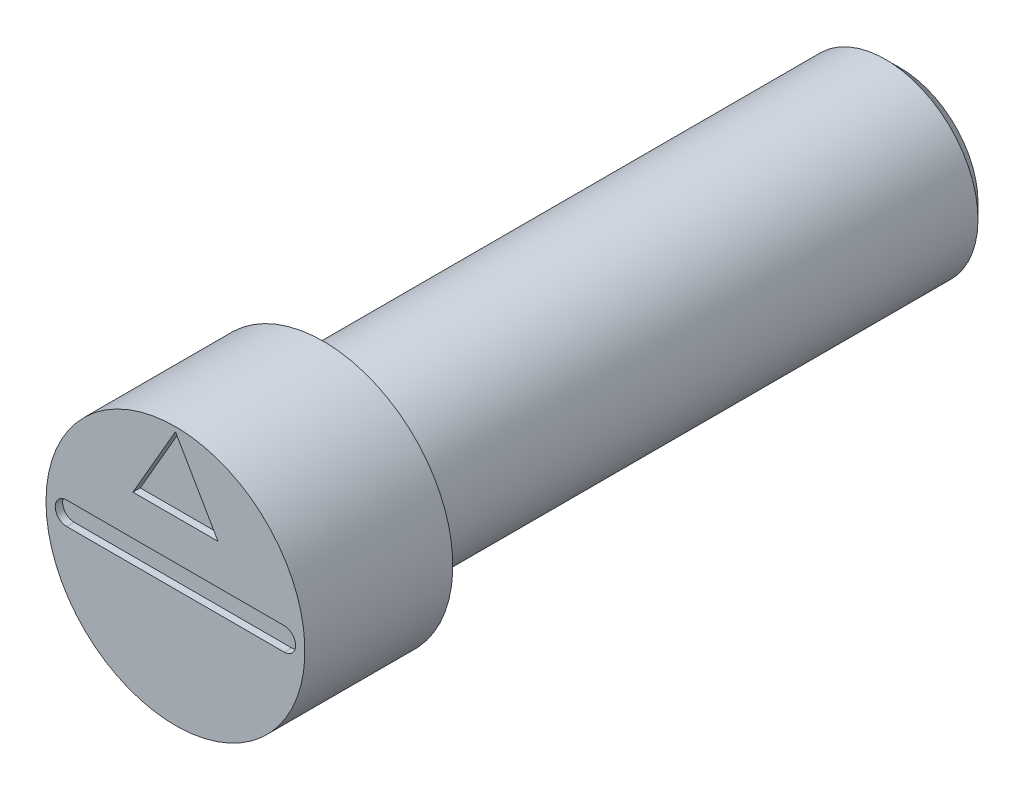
ISO-10303-21;
HEADER;
FILE_DESCRIPTION(('STEP AP214'),'2;1');
FILE_NAME('part.step','',(''),(''),'','','');
FILE_SCHEMA(('AUTOMOTIVE_DESIGN { 1 0 10303 214 1 1 1 1 }'));
ENDSEC;
DATA;
#1=APPLICATION_CONTEXT('core data for automotive mechanical design processes');
#2=APPLICATION_PROTOCOL_DEFINITION('international standard','automotive_design',2000,#1);
#3=PRODUCT_CONTEXT('',#1,'mechanical');
#4=PRODUCT('Part','Part','',(#3));
#5=PRODUCT_RELATED_PRODUCT_CATEGORY('part','',(#4));
#6=PRODUCT_DEFINITION_FORMATION('','',#4);
#7=PRODUCT_DEFINITION_CONTEXT('part definition',#1,'design');
#8=PRODUCT_DEFINITION('design','',#6,#7);
#9=PRODUCT_DEFINITION_SHAPE('','',#8);
#10=(LENGTH_UNIT() NAMED_UNIT(*) SI_UNIT(.MILLI.,.METRE.));
#11=(NAMED_UNIT(*) PLANE_ANGLE_UNIT() SI_UNIT($,.RADIAN.));
#12=(NAMED_UNIT(*) SI_UNIT($,.STERADIAN.) SOLID_ANGLE_UNIT());
#13=UNCERTAINTY_MEASURE_WITH_UNIT(LENGTH_MEASURE(1.E-05),#10,'distance_accuracy_value','');
#14=(GEOMETRIC_REPRESENTATION_CONTEXT(3) GLOBAL_UNCERTAINTY_ASSIGNED_CONTEXT((#13)) GLOBAL_UNIT_ASSIGNED_CONTEXT((#10,
#11,#12)) REPRESENTATION_CONTEXT('',''));
#15=CARTESIAN_POINT('',(0.,0.,0.));
#16=DIRECTION('',(0.,0.,1.));
#17=DIRECTION('',(1.,0.,0.));
#18=AXIS2_PLACEMENT_3D('',#15,#16,#17);
#19=CARTESIAN_POINT('',(0.87499825,0.,0.));
#20=DIRECTION('',(0.,0.,1.));
#21=DIRECTION('',(1.,0.,0.));
#22=AXIS2_PLACEMENT_3D('',#19,#20,#21);
#23=PLANE('',#22);
#24=CARTESIAN_POINT('',(1.47,0.,0.));
#25=DIRECTION('',(0.,0.,1.));
#26=DIRECTION('',(1.,0.,0.));
#27=AXIS2_PLACEMENT_3D('',#24,#25,#26);
#28=CIRCLE('',#27,0.155);
#29=CARTESIAN_POINT('',(1.47,-0.155,0.));
#30=VERTEX_POINT('',#29);
#31=CARTESIAN_POINT('',(1.47,0.155,0.));
#32=VERTEX_POINT('',#31);
#33=EDGE_CURVE('E56',#30,#32,#28,.T.);
#34=ORIENTED_EDGE('',*,*,#33,.F.);
#35=DIRECTION('',(1.,0.,0.));
#36=VECTOR('',#35,1.);
#37=CARTESIAN_POINT('',(-1.47,-0.155,0.));
#38=LINE('',#37,#36);
#39=CARTESIAN_POINT('',(-1.47,-0.155,0.));
#40=VERTEX_POINT('',#39);
#41=EDGE_CURVE('E120',#40,#30,#38,.T.);
#42=ORIENTED_EDGE('',*,*,#41,.F.);
#43=CARTESIAN_POINT('',(-1.47,0.,0.));
#44=DIRECTION('',(0.,0.,1.));
#45=DIRECTION('',(1.,0.,0.));
#46=AXIS2_PLACEMENT_3D('',#43,#44,#45);
#47=CIRCLE('',#46,0.155);
#48=CARTESIAN_POINT('',(-1.47,0.155,0.));
#49=VERTEX_POINT('',#48);
#50=EDGE_CURVE('E123',#49,#40,#47,.T.);
#51=ORIENTED_EDGE('',*,*,#50,.F.);
#52=DIRECTION('',(-1.,0.,0.));
#53=VECTOR('',#52,1.);
#54=CARTESIAN_POINT('',(-1.47,0.155,0.));
#55=LINE('',#54,#53);
#56=EDGE_CURVE('E129',#32,#49,#55,.T.);
#57=ORIENTED_EDGE('',*,*,#56,.F.);
#58=EDGE_LOOP('',(#34,#42,#51,#57));
#59=FACE_BOUND('',#58,.T.);
#60=DIRECTION('',(-0.499999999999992,0.866025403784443,0.));
#61=VECTOR('',#60,1.);
#62=CARTESIAN_POINT('',(0.574999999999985,0.695,0.));
#63=LINE('',#62,#61);
#64=CARTESIAN_POINT('',(0.574999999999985,0.695,0.));
#65=VERTEX_POINT('',#64);
#66=CARTESIAN_POINT('',(0.,1.6909292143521,0.));
#67=VERTEX_POINT('',#66);
#68=EDGE_CURVE('E64',#65,#67,#63,.T.);
#69=ORIENTED_EDGE('',*,*,#68,.F.);
#70=DIRECTION('',(1.,0.,0.));
#71=VECTOR('',#70,1.);
#72=CARTESIAN_POINT('',(-0.575000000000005,0.695,0.));
#73=LINE('',#72,#71);
#74=CARTESIAN_POINT('',(-0.575000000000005,0.695,0.));
#75=VERTEX_POINT('',#74);
#76=EDGE_CURVE('E142',#75,#65,#73,.T.);
#77=ORIENTED_EDGE('',*,*,#76,.F.);
#78=DIRECTION('',(-0.500000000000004,-0.866025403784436,0.));
#79=VECTOR('',#78,1.);
#80=CARTESIAN_POINT('',(0.,1.6909292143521,0.));
#81=LINE('',#80,#79);
#82=EDGE_CURVE('E150',#67,#75,#81,.T.);
#83=ORIENTED_EDGE('',*,*,#82,.F.);
#84=EDGE_LOOP('',(#69,#77,#83));
#85=FACE_BOUND('',#84,.T.);
#86=CARTESIAN_POINT('',(0.,0.,0.));
#87=DIRECTION('',(0.,0.,-1.));
#88=DIRECTION('',(-1.,0.,0.));
#89=AXIS2_PLACEMENT_3D('',#86,#87,#88);
#90=CIRCLE('',#89,1.7499965);
#91=CARTESIAN_POINT('',(-1.74999649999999,0.,0.));
#92=VERTEX_POINT('',#91);
#93=EDGE_CURVE('E157',#92,#92,#90,.T.);
#94=ORIENTED_EDGE('',*,*,#93,.F.);
#95=EDGE_LOOP('',(#94));
#96=FACE_BOUND('',#95,.T.);
#97=ADVANCED_FACE('F40',(#59,#85,#96),#23,.T.);
#98=CARTESIAN_POINT('',(0.,0.,-0.999998));
#99=DIRECTION('',(0.,0.,-1.));
#100=DIRECTION('',(-1.,0.,0.));
#101=AXIS2_PLACEMENT_3D('',#98,#99,#100);
#102=CYLINDRICAL_SURFACE('',#101,1.7499965);
#103=ORIENTED_EDGE('',*,*,#93,.T.);
#104=EDGE_LOOP('',(#103));
#105=FACE_BOUND('',#104,.T.);
#106=CARTESIAN_POINT('',(0.,0.,-1.999996));
#107=DIRECTION('',(0.,0.,-1.));
#108=DIRECTION('',(-1.,0.,0.));
#109=AXIS2_PLACEMENT_3D('',#106,#107,#108);
#110=CIRCLE('',#109,1.7499965);
#111=CARTESIAN_POINT('',(-1.74999649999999,0.,-1.999996));
#112=VERTEX_POINT('',#111);
#113=EDGE_CURVE('E164',#112,#112,#110,.T.);
#114=ORIENTED_EDGE('',*,*,#113,.F.);
#115=EDGE_LOOP('',(#114));
#116=FACE_BOUND('',#115,.T.);
#117=ADVANCED_FACE('F192',(#105,#116),#102,.T.);
#118=CARTESIAN_POINT('',(1.499997,0.,-1.999996));
#119=DIRECTION('',(0.,0.,-1.));
#120=DIRECTION('',(-1.,0.,0.));
#121=AXIS2_PLACEMENT_3D('',#118,#119,#120);
#122=PLANE('',#121);
#123=CARTESIAN_POINT('',(0.,0.,-1.999996));
#124=DIRECTION('',(0.,0.,-1.));
#125=DIRECTION('',(-1.,0.,0.));
#126=AXIS2_PLACEMENT_3D('',#123,#124,#125);
#127=CIRCLE('',#126,1.2499975);
#128=CARTESIAN_POINT('',(-1.24999749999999,0.,-1.999996));
#129=VERTEX_POINT('',#128);
#130=EDGE_CURVE('E161',#129,#129,#127,.T.);
#131=ORIENTED_EDGE('',*,*,#130,.F.);
#132=EDGE_LOOP('',(#131));
#133=FACE_BOUND('',#132,.T.);
#134=ORIENTED_EDGE('',*,*,#113,.T.);
#135=EDGE_LOOP('',(#134));
#136=FACE_BOUND('',#135,.T.);
#137=ADVANCED_FACE('F183',(#133,#136),#122,.T.);
#138=CARTESIAN_POINT('',(0.,0.,-8.499983));
#139=DIRECTION('',(0.,0.,-1.));
#140=DIRECTION('',(-1.,0.,0.));
#141=AXIS2_PLACEMENT_3D('',#138,#139,#140);
#142=CYLINDRICAL_SURFACE('',#141,1.2499975);
#143=CARTESIAN_POINT('',(0.,0.,-9.6));
#144=DIRECTION('',(0.,0.,1.));
#145=DIRECTION('',(1.,0.,0.));
#146=AXIS2_PLACEMENT_3D('',#143,#144,#145);
#147=CIRCLE('',#146,1.2499975);
#148=CARTESIAN_POINT('',(1.24999750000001,0.,-9.6));
#149=VERTEX_POINT('',#148);
#150=EDGE_CURVE('E12',#149,#149,#147,.T.);
#151=ORIENTED_EDGE('',*,*,#150,.T.);
#152=EDGE_LOOP('',(#151));
#153=FACE_BOUND('',#152,.T.);
#154=ORIENTED_EDGE('',*,*,#130,.T.);
#155=EDGE_LOOP('',(#154));
#156=FACE_BOUND('',#155,.T.);
#157=ADVANCED_FACE('F180',(#153,#156),#142,.T.);
#158=CARTESIAN_POINT('',(0.574999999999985,0.695,-0.1));
#159=DIRECTION('',(0.866025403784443,0.499999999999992,0.));
#160=DIRECTION('',(-0.499999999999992,0.866025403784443,0.));
#161=AXIS2_PLACEMENT_3D('',#158,#159,#160);
#162=PLANE('',#161);
#163=ORIENTED_EDGE('',*,*,#68,.T.);
#164=DIRECTION('',(0.,0.,1.));
#165=VECTOR('',#164,1.);
#166=CARTESIAN_POINT('',(0.,1.6909292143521,-0.1));
#167=LINE('',#166,#165);
#168=CARTESIAN_POINT('',(0.,1.6909292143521,-0.1));
#169=VERTEX_POINT('',#168);
#170=EDGE_CURVE('E148',#169,#67,#167,.T.);
#171=ORIENTED_EDGE('',*,*,#170,.F.);
#172=DIRECTION('',(-0.499999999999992,0.866025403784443,0.));
#173=VECTOR('',#172,1.);
#174=CARTESIAN_POINT('',(0.574999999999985,0.695,-0.1));
#175=LINE('',#174,#173);
#176=CARTESIAN_POINT('',(0.574999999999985,0.695,-0.1));
#177=VERTEX_POINT('',#176);
#178=EDGE_CURVE('E138',#177,#169,#175,.T.);
#179=ORIENTED_EDGE('',*,*,#178,.F.);
#180=DIRECTION('',(0.,0.,1.));
#181=VECTOR('',#180,1.);
#182=CARTESIAN_POINT('',(0.574999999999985,0.695,-0.1));
#183=LINE('',#182,#181);
#184=EDGE_CURVE('E155',#177,#65,#183,.T.);
#185=ORIENTED_EDGE('',*,*,#184,.T.);
#186=EDGE_LOOP('',(#163,#171,#179,#185));
#187=FACE_BOUND('',#186,.T.);
#188=ADVANCED_FACE('F182',(#187),#162,.F.);
#189=CARTESIAN_POINT('',(-0.575000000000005,0.695,-0.1));
#190=DIRECTION('',(0.,-1.,0.));
#191=DIRECTION('',(1.,0.,0.));
#192=AXIS2_PLACEMENT_3D('',#189,#190,#191);
#193=PLANE('',#192);
#194=ORIENTED_EDGE('',*,*,#76,.T.);
#195=ORIENTED_EDGE('',*,*,#184,.F.);
#196=DIRECTION('',(1.,0.,0.));
#197=VECTOR('',#196,1.);
#198=CARTESIAN_POINT('',(-0.575000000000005,0.695,-0.1));
#199=LINE('',#198,#197);
#200=CARTESIAN_POINT('',(-0.575000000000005,0.695,-0.1));
#201=VERTEX_POINT('',#200);
#202=EDGE_CURVE('E145',#201,#177,#199,.T.);
#203=ORIENTED_EDGE('',*,*,#202,.F.);
#204=DIRECTION('',(0.,0.,1.));
#205=VECTOR('',#204,1.);
#206=CARTESIAN_POINT('',(-0.575000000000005,0.695,-0.1));
#207=LINE('',#206,#205);
#208=EDGE_CURVE('E158',#201,#75,#207,.T.);
#209=ORIENTED_EDGE('',*,*,#208,.T.);
#210=EDGE_LOOP('',(#194,#195,#203,#209));
#211=FACE_BOUND('',#210,.T.);
#212=ADVANCED_FACE('F190',(#211),#193,.F.);
#213=CARTESIAN_POINT('',(0.,1.6909292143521,-0.1));
#214=DIRECTION('',(-0.866025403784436,0.500000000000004,0.));
#215=DIRECTION('',(-0.500000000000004,-0.866025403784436,0.));
#216=AXIS2_PLACEMENT_3D('',#213,#214,#215);
#217=PLANE('',#216);
#218=ORIENTED_EDGE('',*,*,#82,.T.);
#219=ORIENTED_EDGE('',*,*,#208,.F.);
#220=DIRECTION('',(-0.500000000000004,-0.866025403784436,0.));
#221=VECTOR('',#220,1.);
#222=CARTESIAN_POINT('',(0.,1.6909292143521,-0.1));
#223=LINE('',#222,#221);
#224=EDGE_CURVE('E141',#169,#201,#223,.T.);
#225=ORIENTED_EDGE('',*,*,#224,.F.);
#226=ORIENTED_EDGE('',*,*,#170,.T.);
#227=EDGE_LOOP('',(#218,#219,#225,#226));
#228=FACE_BOUND('',#227,.T.);
#229=ADVANCED_FACE('F214',(#228),#217,.F.);
#230=CARTESIAN_POINT('',(0.,0.,-0.1));
#231=DIRECTION('',(0.,0.,1.));
#232=DIRECTION('',(1.,0.,0.));
#233=AXIS2_PLACEMENT_3D('',#230,#231,#232);
#234=PLANE('',#233);
#235=ORIENTED_EDGE('',*,*,#178,.T.);
#236=ORIENTED_EDGE('',*,*,#224,.T.);
#237=ORIENTED_EDGE('',*,*,#202,.T.);
#238=EDGE_LOOP('',(#235,#236,#237));
#239=FACE_BOUND('',#238,.T.);
#240=ADVANCED_FACE('F219',(#239),#234,.T.);
#241=CARTESIAN_POINT('',(1.47,0.,-0.1));
#242=DIRECTION('',(0.,0.,1.));
#243=DIRECTION('',(1.,0.,0.));
#244=AXIS2_PLACEMENT_3D('',#241,#242,#243);
#245=CYLINDRICAL_SURFACE('',#244,0.155);
#246=ORIENTED_EDGE('',*,*,#33,.T.);
#247=DIRECTION('',(0.,0.,1.));
#248=VECTOR('',#247,1.);
#249=CARTESIAN_POINT('',(1.47,0.155,-0.1));
#250=LINE('',#249,#248);
#251=CARTESIAN_POINT('',(1.47,0.155,-0.1));
#252=VERTEX_POINT('',#251);
#253=EDGE_CURVE('E98',#252,#32,#250,.T.);
#254=ORIENTED_EDGE('',*,*,#253,.F.);
#255=CARTESIAN_POINT('',(1.47,0.,-0.1));
#256=DIRECTION('',(0.,0.,1.));
#257=DIRECTION('',(1.,0.,0.));
#258=AXIS2_PLACEMENT_3D('',#255,#256,#257);
#259=CIRCLE('',#258,0.155);
#260=CARTESIAN_POINT('',(1.47,-0.155,-0.1));
#261=VERTEX_POINT('',#260);
#262=EDGE_CURVE('E102',#261,#252,#259,.T.);
#263=ORIENTED_EDGE('',*,*,#262,.F.);
#264=DIRECTION('',(0.,0.,1.));
#265=VECTOR('',#264,1.);
#266=CARTESIAN_POINT('',(1.47,-0.155,-0.1));
#267=LINE('',#266,#265);
#268=EDGE_CURVE('E133',#261,#30,#267,.T.);
#269=ORIENTED_EDGE('',*,*,#268,.T.);
#270=EDGE_LOOP('',(#246,#254,#263,#269));
#271=FACE_BOUND('',#270,.T.);
#272=ADVANCED_FACE('F100',(#271),#245,.F.);
#273=CARTESIAN_POINT('',(-1.47,-0.155,-0.1));
#274=DIRECTION('',(0.,-1.,0.));
#275=DIRECTION('',(1.,0.,0.));
#276=AXIS2_PLACEMENT_3D('',#273,#274,#275);
#277=PLANE('',#276);
#278=ORIENTED_EDGE('',*,*,#41,.T.);
#279=ORIENTED_EDGE('',*,*,#268,.F.);
#280=DIRECTION('',(1.,0.,0.));
#281=VECTOR('',#280,1.);
#282=CARTESIAN_POINT('',(-1.47,-0.155,-0.1));
#283=LINE('',#282,#281);
#284=CARTESIAN_POINT('',(-1.47,-0.155,-0.1));
#285=VERTEX_POINT('',#284);
#286=EDGE_CURVE('E108',#285,#261,#283,.T.);
#287=ORIENTED_EDGE('',*,*,#286,.F.);
#288=DIRECTION('',(0.,0.,1.));
#289=VECTOR('',#288,1.);
#290=CARTESIAN_POINT('',(-1.47,-0.155,-0.1));
#291=LINE('',#290,#289);
#292=EDGE_CURVE('E135',#285,#40,#291,.T.);
#293=ORIENTED_EDGE('',*,*,#292,.T.);
#294=EDGE_LOOP('',(#278,#279,#287,#293));
#295=FACE_BOUND('',#294,.T.);
#296=ADVANCED_FACE('F231',(#295),#277,.F.);
#297=CARTESIAN_POINT('',(-1.47,0.,-0.1));
#298=DIRECTION('',(0.,0.,1.));
#299=DIRECTION('',(1.,0.,0.));
#300=AXIS2_PLACEMENT_3D('',#297,#298,#299);
#301=CYLINDRICAL_SURFACE('',#300,0.155);
#302=ORIENTED_EDGE('',*,*,#50,.T.);
#303=ORIENTED_EDGE('',*,*,#292,.F.);
#304=CARTESIAN_POINT('',(-1.47,0.,-0.1));
#305=DIRECTION('',(0.,0.,1.));
#306=DIRECTION('',(1.,0.,0.));
#307=AXIS2_PLACEMENT_3D('',#304,#305,#306);
#308=CIRCLE('',#307,0.155);
#309=CARTESIAN_POINT('',(-1.47,0.155,-0.1));
#310=VERTEX_POINT('',#309);
#311=EDGE_CURVE('E116',#310,#285,#308,.T.);
#312=ORIENTED_EDGE('',*,*,#311,.F.);
#313=DIRECTION('',(0.,0.,1.));
#314=VECTOR('',#313,1.);
#315=CARTESIAN_POINT('',(-1.47,0.155,-0.1));
#316=LINE('',#315,#314);
#317=EDGE_CURVE('E107',#310,#49,#316,.T.);
#318=ORIENTED_EDGE('',*,*,#317,.T.);
#319=EDGE_LOOP('',(#302,#303,#312,#318));
#320=FACE_BOUND('',#319,.T.);
#321=ADVANCED_FACE('F234',(#320),#301,.F.);
#322=CARTESIAN_POINT('',(-1.47,0.155,-0.1));
#323=DIRECTION('',(0.,1.,0.));
#324=DIRECTION('',(-1.,0.,0.));
#325=AXIS2_PLACEMENT_3D('',#322,#323,#324);
#326=PLANE('',#325);
#327=ORIENTED_EDGE('',*,*,#56,.T.);
#328=ORIENTED_EDGE('',*,*,#317,.F.);
#329=DIRECTION('',(-1.,0.,0.));
#330=VECTOR('',#329,1.);
#331=CARTESIAN_POINT('',(-1.47,0.155,-0.1));
#332=LINE('',#331,#330);
#333=EDGE_CURVE('E111',#252,#310,#332,.T.);
#334=ORIENTED_EDGE('',*,*,#333,.F.);
#335=ORIENTED_EDGE('',*,*,#253,.T.);
#336=EDGE_LOOP('',(#327,#328,#334,#335));
#337=FACE_BOUND('',#336,.T.);
#338=ADVANCED_FACE('F112',(#337),#326,.F.);
#339=CARTESIAN_POINT('',(1.47,0.,-0.1));
#340=DIRECTION('',(0.,0.,1.));
#341=DIRECTION('',(1.,0.,0.));
#342=AXIS2_PLACEMENT_3D('',#339,#340,#341);
#343=PLANE('',#342);
#344=ORIENTED_EDGE('',*,*,#262,.T.);
#345=ORIENTED_EDGE('',*,*,#333,.T.);
#346=ORIENTED_EDGE('',*,*,#311,.T.);
#347=ORIENTED_EDGE('',*,*,#286,.T.);
#348=EDGE_LOOP('',(#344,#345,#346,#347));
#349=FACE_BOUND('',#348,.T.);
#350=ADVANCED_FACE('F118',(#349),#343,.T.);
#351=CARTESIAN_POINT('',(0.87499825,0.,-9.8));
#352=DIRECTION('',(0.,0.,1.));
#353=DIRECTION('',(1.,0.,0.));
#354=AXIS2_PLACEMENT_3D('',#351,#352,#353);
#355=PLANE('',#354);
#356=CARTESIAN_POINT('',(0.,0.,-9.8));
#357=DIRECTION('',(0.,0.,1.));
#358=DIRECTION('',(1.,0.,0.));
#359=AXIS2_PLACEMENT_3D('',#356,#357,#358);
#360=CIRCLE('',#359,1.0499975);
#361=CARTESIAN_POINT('',(1.04999750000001,0.,-9.8));
#362=VERTEX_POINT('',#361);
#363=EDGE_CURVE('E49',#362,#362,#360,.F.);
#364=ORIENTED_EDGE('',*,*,#363,.T.);
#365=EDGE_LOOP('',(#364));
#366=FACE_BOUND('',#365,.T.);
#367=ADVANCED_FACE('F171',(#366),#355,.F.);
#368=CARTESIAN_POINT('',(0.,0.,-9.8));
#369=DIRECTION('',(0.,0.,1.));
#370=DIRECTION('',(1.,0.,0.));
#371=AXIS2_PLACEMENT_3D('',#368,#369,#370);
#372=CONICAL_SURFACE('',#371,1.0499975,0.785398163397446);
#373=ORIENTED_EDGE('',*,*,#150,.F.);
#374=EDGE_LOOP('',(#373));
#375=FACE_BOUND('',#374,.T.);
#376=ORIENTED_EDGE('',*,*,#363,.F.);
#377=EDGE_LOOP('',(#376));
#378=FACE_BOUND('',#377,.T.);
#379=ADVANCED_FACE('F43',(#375,#378),#372,.T.);
#380=CLOSED_SHELL('',(#97,#117,#137,#157,#188,#212,#229,#240,#272,#296,#321,#338,#350,#367,#379));
#381=MANIFOLD_SOLID_BREP('B2',#380);
#382=ADVANCED_BREP_SHAPE_REPRESENTATION('',(#18,#381),#14);
#383=SHAPE_DEFINITION_REPRESENTATION(#9,#382);
ENDSEC;
END-ISO-10303-21;
